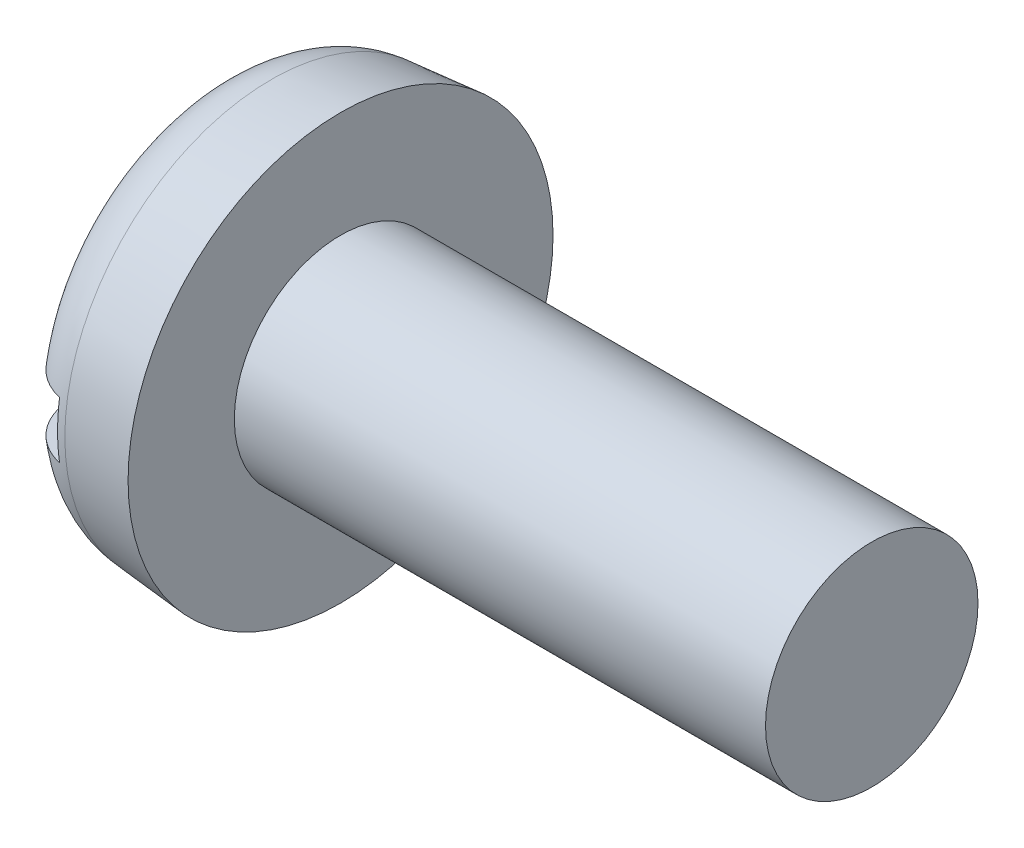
from build123d import *

# Parameters (mm, degrees)
FILLET2_R  = 1.8
SKETCH2_W  = 12
SKETCH2_H  = 1.6
SLOT_DEPTH = 1.4


with BuildPart() as part:
    # BodySke → Base-Revolve (revolve)
    with BuildSketch(Plane.XY, mode=Mode.PRIVATE) as base_revolve_sk:
        Polygon((3.6, 3), (3.6, 6), (0, 5.685040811), (0, 0), (18.6, 0), (18.6, 3), align=None)
    revolve(base_revolve_sk.sketch.rotate(Axis((-25.4, 0, 0), (1, 0, 0)), 90), axis=Axis((-25.4, 0, 0), (1, 0, 0)))

    # Fillet2
    fillet2_edges = [part.edges().sort_by_distance(p)[0] for p in [
        (0, 0, -5.685040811),
    ]]
    fillet(fillet2_edges, radius=FILLET2_R)

    # Sketch2 → Slot (cut)
    with BuildSketch(Plane(origin=(0, 0, 0), x_dir=(0, 0, -1), z_dir=(1, 0, 0))):
        Rectangle(SKETCH2_W, SKETCH2_H)
    extrude(amount=SLOT_DEPTH, mode=Mode.SUBTRACT)


solid = part.part
